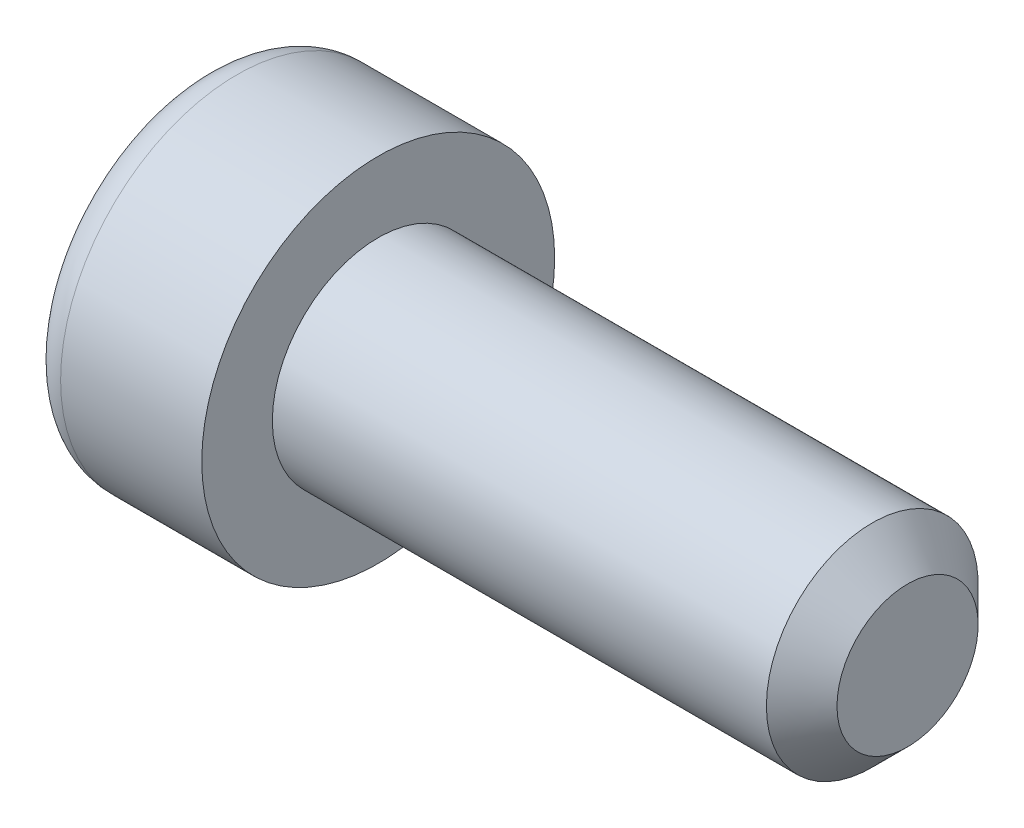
ISO-10303-21;
HEADER;
FILE_DESCRIPTION(('STEP AP214'),'2;1');
FILE_NAME('part.step','',(''),(''),'','','');
FILE_SCHEMA(('AUTOMOTIVE_DESIGN { 1 0 10303 214 1 1 1 1 }'));
ENDSEC;
DATA;
#1=APPLICATION_CONTEXT('core data for automotive mechanical design processes');
#2=APPLICATION_PROTOCOL_DEFINITION('international standard','automotive_design',2000,#1);
#3=PRODUCT_CONTEXT('',#1,'mechanical');
#4=PRODUCT('Part','Part','',(#3));
#5=PRODUCT_RELATED_PRODUCT_CATEGORY('part','',(#4));
#6=PRODUCT_DEFINITION_FORMATION('','',#4);
#7=PRODUCT_DEFINITION_CONTEXT('part definition',#1,'design');
#8=PRODUCT_DEFINITION('design','',#6,#7);
#9=PRODUCT_DEFINITION_SHAPE('','',#8);
#10=(LENGTH_UNIT() NAMED_UNIT(*) SI_UNIT(.MILLI.,.METRE.));
#11=(NAMED_UNIT(*) PLANE_ANGLE_UNIT() SI_UNIT($,.RADIAN.));
#12=(NAMED_UNIT(*) SI_UNIT($,.STERADIAN.) SOLID_ANGLE_UNIT());
#13=UNCERTAINTY_MEASURE_WITH_UNIT(LENGTH_MEASURE(1.E-05),#10,'distance_accuracy_value','');
#14=(GEOMETRIC_REPRESENTATION_CONTEXT(3) GLOBAL_UNCERTAINTY_ASSIGNED_CONTEXT((#13)) GLOBAL_UNIT_ASSIGNED_CONTEXT((#10,
#11,#12)) REPRESENTATION_CONTEXT('',''));
#15=CARTESIAN_POINT('',(0.,0.,0.));
#16=DIRECTION('',(0.,0.,1.));
#17=DIRECTION('',(1.,0.,0.));
#18=AXIS2_PLACEMENT_3D('',#15,#16,#17);
#19=CARTESIAN_POINT('',(41.305464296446,0.,0.));
#20=DIRECTION('',(-1.,0.,0.));
#21=DIRECTION('',(0.,0.,1.));
#22=AXIS2_PLACEMENT_3D('',#19,#20,#21);
#23=PLANE('',#22);
#24=CARTESIAN_POINT('',(41.305464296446,0.,0.));
#25=DIRECTION('',(-1.,0.,0.));
#26=DIRECTION('',(0.,0.,1.));
#27=AXIS2_PLACEMENT_3D('',#24,#25,#26);
#28=CIRCLE('',#27,2.);
#29=CARTESIAN_POINT('',(41.305464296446,0.,2.));
#30=VERTEX_POINT('',#29);
#31=EDGE_CURVE('E11',#30,#30,#28,.T.);
#32=ORIENTED_EDGE('',*,*,#31,.F.);
#33=EDGE_LOOP('',(#32));
#34=FACE_BOUND('',#33,.T.);
#35=ADVANCED_FACE('F33',(#34),#23,.F.);
#36=CARTESIAN_POINT('',(41.305464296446,0.,0.));
#37=DIRECTION('',(-1.,0.,0.));
#38=DIRECTION('',(0.,0.,1.));
#39=AXIS2_PLACEMENT_3D('',#36,#37,#38);
#40=CONICAL_SURFACE('',#39,2.,0.785398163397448);
#41=CARTESIAN_POINT('',(40.305464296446,0.,0.));
#42=DIRECTION('',(-1.,0.,0.));
#43=DIRECTION('',(0.,0.,1.));
#44=AXIS2_PLACEMENT_3D('',#41,#42,#43);
#45=CIRCLE('',#44,3.);
#46=CARTESIAN_POINT('',(40.305464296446,0.,3.));
#47=VERTEX_POINT('',#46);
#48=EDGE_CURVE('E40',#47,#47,#45,.T.);
#49=ORIENTED_EDGE('',*,*,#48,.F.);
#50=EDGE_LOOP('',(#49));
#51=FACE_BOUND('',#50,.T.);
#52=ORIENTED_EDGE('',*,*,#31,.T.);
#53=EDGE_LOOP('',(#52));
#54=FACE_BOUND('',#53,.T.);
#55=ADVANCED_FACE('F155',(#51,#54),#40,.T.);
#56=CARTESIAN_POINT('',(-45.6086238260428,0.,0.));
#57=DIRECTION('',(-1.,0.,0.));
#58=DIRECTION('',(0.,0.,1.));
#59=AXIS2_PLACEMENT_3D('',#56,#57,#58);
#60=CYLINDRICAL_SURFACE('',#59,3.);
#61=CARTESIAN_POINT('',(26.305464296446,0.,0.));
#62=DIRECTION('',(-1.,0.,0.));
#63=DIRECTION('',(0.,0.,1.));
#64=AXIS2_PLACEMENT_3D('',#61,#62,#63);
#65=CIRCLE('',#64,3.);
#66=CARTESIAN_POINT('',(26.305464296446,0.,3.));
#67=VERTEX_POINT('',#66);
#68=EDGE_CURVE('E148',#67,#67,#65,.T.);
#69=ORIENTED_EDGE('',*,*,#68,.F.);
#70=EDGE_LOOP('',(#69));
#71=FACE_BOUND('',#70,.T.);
#72=ORIENTED_EDGE('',*,*,#48,.T.);
#73=EDGE_LOOP('',(#72));
#74=FACE_BOUND('',#73,.T.);
#75=ADVANCED_FACE('F153',(#71,#74),#60,.T.);
#76=CARTESIAN_POINT('',(26.305464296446,3.,0.));
#77=DIRECTION('',(-1.,0.,0.));
#78=DIRECTION('',(0.,0.,1.));
#79=AXIS2_PLACEMENT_3D('',#76,#77,#78);
#80=PLANE('',#79);
#81=CARTESIAN_POINT('',(26.305464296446,0.,0.));
#82=DIRECTION('',(-1.,0.,0.));
#83=DIRECTION('',(0.,0.,1.));
#84=AXIS2_PLACEMENT_3D('',#81,#82,#83);
#85=CIRCLE('',#84,5.);
#86=CARTESIAN_POINT('',(26.305464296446,0.,5.));
#87=VERTEX_POINT('',#86);
#88=EDGE_CURVE('E145',#87,#87,#85,.T.);
#89=ORIENTED_EDGE('',*,*,#88,.F.);
#90=EDGE_LOOP('',(#89));
#91=FACE_BOUND('',#90,.T.);
#92=ORIENTED_EDGE('',*,*,#68,.T.);
#93=EDGE_LOOP('',(#92));
#94=FACE_BOUND('',#93,.T.);
#95=ADVANCED_FACE('F173',(#91,#94),#80,.F.);
#96=CARTESIAN_POINT('',(-45.6086238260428,0.,0.));
#97=DIRECTION('',(-1.,0.,0.));
#98=DIRECTION('',(0.,0.,1.));
#99=AXIS2_PLACEMENT_3D('',#96,#97,#98);
#100=CYLINDRICAL_SURFACE('',#99,5.);
#101=CARTESIAN_POINT('',(22.305464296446,0.,0.));
#102=DIRECTION('',(-1.,0.,0.));
#103=DIRECTION('',(0.,0.,1.));
#104=AXIS2_PLACEMENT_3D('',#101,#102,#103);
#105=CIRCLE('',#104,5.);
#106=CARTESIAN_POINT('',(22.305464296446,0.,5.));
#107=VERTEX_POINT('',#106);
#108=EDGE_CURVE('E142',#107,#107,#105,.T.);
#109=ORIENTED_EDGE('',*,*,#108,.F.);
#110=EDGE_LOOP('',(#109));
#111=FACE_BOUND('',#110,.T.);
#112=ORIENTED_EDGE('',*,*,#88,.T.);
#113=EDGE_LOOP('',(#112));
#114=FACE_BOUND('',#113,.T.);
#115=ADVANCED_FACE('F181',(#111,#114),#100,.T.);
#116=CARTESIAN_POINT('',(22.305464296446,0.,0.));
#117=DIRECTION('',(-1.,0.,0.));
#118=DIRECTION('',(0.,0.,1.));
#119=AXIS2_PLACEMENT_3D('',#116,#117,#118);
#120=TOROIDAL_SURFACE('',#119,4.,1.);
#121=CARTESIAN_POINT('',(21.305464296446,0.,0.));
#122=DIRECTION('',(-1.,0.,0.));
#123=DIRECTION('',(0.,0.,1.));
#124=AXIS2_PLACEMENT_3D('',#121,#122,#123);
#125=CIRCLE('',#124,3.99999999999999);
#126=CARTESIAN_POINT('',(21.305464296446,0.,3.99999999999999));
#127=VERTEX_POINT('',#126);
#128=EDGE_CURVE('E134',#127,#127,#125,.T.);
#129=ORIENTED_EDGE('',*,*,#128,.F.);
#130=EDGE_LOOP('',(#129));
#131=FACE_BOUND('',#130,.T.);
#132=ORIENTED_EDGE('',*,*,#108,.T.);
#133=EDGE_LOOP('',(#132));
#134=FACE_BOUND('',#133,.T.);
#135=ADVANCED_FACE('F189',(#131,#134),#120,.T.);
#136=CARTESIAN_POINT('',(21.305464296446,3.99999999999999,0.));
#137=DIRECTION('',(1.,0.,0.));
#138=DIRECTION('',(0.,0.,-1.));
#139=AXIS2_PLACEMENT_3D('',#136,#137,#138);
#140=PLANE('',#139);
#141=DIRECTION('',(0.,-0.500000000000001,-0.866025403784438));
#142=VECTOR('',#141,1.);
#143=CARTESIAN_POINT('',(21.305464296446,2.23575188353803,0.));
#144=LINE('',#143,#142);
#145=CARTESIAN_POINT('',(21.305464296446,2.23575188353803,0.));
#146=VERTEX_POINT('',#145);
#147=CARTESIAN_POINT('',(21.305464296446,1.11787594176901,-1.93621792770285));
#148=VERTEX_POINT('',#147);
#149=EDGE_CURVE('E121',#146,#148,#144,.T.);
#150=ORIENTED_EDGE('',*,*,#149,.F.);
#151=DIRECTION('',(0.,0.499999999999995,-0.866025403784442));
#152=VECTOR('',#151,1.);
#153=CARTESIAN_POINT('',(21.305464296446,1.11787594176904,1.93621792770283));
#154=LINE('',#153,#152);
#155=CARTESIAN_POINT('',(21.305464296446,1.11787594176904,1.93621792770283));
#156=VERTEX_POINT('',#155);
#157=EDGE_CURVE('E47',#156,#146,#154,.T.);
#158=ORIENTED_EDGE('',*,*,#157,.F.);
#159=DIRECTION('',(0.,1.,0.));
#160=VECTOR('',#159,1.);
#161=CARTESIAN_POINT('',(21.305464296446,-1.117875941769,1.93621792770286));
#162=LINE('',#161,#160);
#163=CARTESIAN_POINT('',(21.305464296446,-1.117875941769,1.93621792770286));
#164=VERTEX_POINT('',#163);
#165=EDGE_CURVE('E130',#164,#156,#162,.T.);
#166=ORIENTED_EDGE('',*,*,#165,.F.);
#167=DIRECTION('',(0.,0.500000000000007,0.866025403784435));
#168=VECTOR('',#167,1.);
#169=CARTESIAN_POINT('',(21.305464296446,-2.23575188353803,0.));
#170=LINE('',#169,#168);
#171=CARTESIAN_POINT('',(21.305464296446,-2.23575188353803,0.));
#172=VERTEX_POINT('',#171);
#173=EDGE_CURVE('E128',#172,#164,#170,.T.);
#174=ORIENTED_EDGE('',*,*,#173,.F.);
#175=DIRECTION('',(0.,-0.499999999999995,0.866025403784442));
#176=VECTOR('',#175,1.);
#177=CARTESIAN_POINT('',(21.305464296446,-1.11787594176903,-1.93621792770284));
#178=LINE('',#177,#176);
#179=CARTESIAN_POINT('',(21.305464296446,-1.11787594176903,-1.93621792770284));
#180=VERTEX_POINT('',#179);
#181=EDGE_CURVE('E95',#180,#172,#178,.T.);
#182=ORIENTED_EDGE('',*,*,#181,.F.);
#183=DIRECTION('',(0.,-1.,0.));
#184=VECTOR('',#183,1.);
#185=CARTESIAN_POINT('',(21.305464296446,1.11787594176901,-1.93621792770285));
#186=LINE('',#185,#184);
#187=EDGE_CURVE('E124',#148,#180,#186,.T.);
#188=ORIENTED_EDGE('',*,*,#187,.F.);
#189=EDGE_LOOP('',(#150,#158,#166,#174,#182,#188));
#190=FACE_BOUND('',#189,.T.);
#191=ORIENTED_EDGE('',*,*,#128,.T.);
#192=EDGE_LOOP('',(#191));
#193=FACE_BOUND('',#192,.T.);
#194=ADVANCED_FACE('F197',(#190,#193),#140,.F.);
#195=CARTESIAN_POINT('',(24.305464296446,1.11787594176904,1.93621792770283));
#196=DIRECTION('',(0.,0.866025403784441,0.499999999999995));
#197=DIRECTION('',(0.,-0.499999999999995,0.866025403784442));
#198=AXIS2_PLACEMENT_3D('',#195,#196,#197);
#199=PLANE('',#198);
#200=ORIENTED_EDGE('',*,*,#157,.T.);
#201=DIRECTION('',(-1.,0.,0.));
#202=VECTOR('',#201,1.);
#203=CARTESIAN_POINT('',(24.305464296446,2.23575188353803,0.));
#204=LINE('',#203,#202);
#205=CARTESIAN_POINT('',(24.305464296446,2.23575188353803,0.));
#206=VERTEX_POINT('',#205);
#207=EDGE_CURVE('E77',#206,#146,#204,.T.);
#208=ORIENTED_EDGE('',*,*,#207,.F.);
#209=DIRECTION('',(0.,0.499999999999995,-0.866025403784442));
#210=VECTOR('',#209,1.);
#211=CARTESIAN_POINT('',(24.305464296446,1.11787594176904,1.93621792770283));
#212=LINE('',#211,#210);
#213=CARTESIAN_POINT('',(24.305464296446,1.11787594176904,1.93621792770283));
#214=VERTEX_POINT('',#213);
#215=EDGE_CURVE('E132',#214,#206,#212,.T.);
#216=ORIENTED_EDGE('',*,*,#215,.F.);
#217=DIRECTION('',(-1.,0.,0.));
#218=VECTOR('',#217,1.);
#219=CARTESIAN_POINT('',(24.305464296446,1.11787594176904,1.93621792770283));
#220=LINE('',#219,#218);
#221=EDGE_CURVE('E55',#214,#156,#220,.T.);
#222=ORIENTED_EDGE('',*,*,#221,.T.);
#223=EDGE_LOOP('',(#200,#208,#216,#222));
#224=FACE_BOUND('',#223,.T.);
#225=ADVANCED_FACE('F206',(#224),#199,.F.);
#226=CARTESIAN_POINT('',(24.305464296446,-1.117875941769,1.93621792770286));
#227=DIRECTION('',(0.,0.,1.));
#228=DIRECTION('',(0.,-1.,0.));
#229=AXIS2_PLACEMENT_3D('',#226,#227,#228);
#230=PLANE('',#229);
#231=ORIENTED_EDGE('',*,*,#165,.T.);
#232=ORIENTED_EDGE('',*,*,#221,.F.);
#233=DIRECTION('',(0.,1.,0.));
#234=VECTOR('',#233,1.);
#235=CARTESIAN_POINT('',(24.305464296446,-1.117875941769,1.93621792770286));
#236=LINE('',#235,#234);
#237=CARTESIAN_POINT('',(24.305464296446,-1.117875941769,1.93621792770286));
#238=VERTEX_POINT('',#237);
#239=EDGE_CURVE('E107',#238,#214,#236,.T.);
#240=ORIENTED_EDGE('',*,*,#239,.F.);
#241=DIRECTION('',(-1.,0.,0.));
#242=VECTOR('',#241,1.);
#243=CARTESIAN_POINT('',(24.305464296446,-1.117875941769,1.93621792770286));
#244=LINE('',#243,#242);
#245=EDGE_CURVE('E99',#238,#164,#244,.T.);
#246=ORIENTED_EDGE('',*,*,#245,.T.);
#247=EDGE_LOOP('',(#231,#232,#240,#246));
#248=FACE_BOUND('',#247,.T.);
#249=ADVANCED_FACE('F216',(#248),#230,.F.);
#250=CARTESIAN_POINT('',(24.305464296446,-2.23575188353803,0.));
#251=DIRECTION('',(0.,-0.866025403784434,0.500000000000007));
#252=DIRECTION('',(0.,-0.500000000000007,-0.866025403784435));
#253=AXIS2_PLACEMENT_3D('',#250,#251,#252);
#254=PLANE('',#253);
#255=ORIENTED_EDGE('',*,*,#173,.T.);
#256=ORIENTED_EDGE('',*,*,#245,.F.);
#257=DIRECTION('',(0.,0.500000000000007,0.866025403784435));
#258=VECTOR('',#257,1.);
#259=CARTESIAN_POINT('',(24.305464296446,-2.23575188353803,0.));
#260=LINE('',#259,#258);
#261=CARTESIAN_POINT('',(24.305464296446,-2.23575188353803,0.));
#262=VERTEX_POINT('',#261);
#263=EDGE_CURVE('E103',#262,#238,#260,.T.);
#264=ORIENTED_EDGE('',*,*,#263,.F.);
#265=DIRECTION('',(-1.,0.,0.));
#266=VECTOR('',#265,1.);
#267=CARTESIAN_POINT('',(24.305464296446,-2.23575188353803,0.));
#268=LINE('',#267,#266);
#269=EDGE_CURVE('E88',#262,#172,#268,.T.);
#270=ORIENTED_EDGE('',*,*,#269,.T.);
#271=EDGE_LOOP('',(#255,#256,#264,#270));
#272=FACE_BOUND('',#271,.T.);
#273=ADVANCED_FACE('F104',(#272),#254,.F.);
#274=CARTESIAN_POINT('',(24.305464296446,-1.11787594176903,-1.93621792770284));
#275=DIRECTION('',(0.,-0.866025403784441,-0.499999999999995));
#276=DIRECTION('',(0.,0.499999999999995,-0.866025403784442));
#277=AXIS2_PLACEMENT_3D('',#274,#275,#276);
#278=PLANE('',#277);
#279=ORIENTED_EDGE('',*,*,#181,.T.);
#280=ORIENTED_EDGE('',*,*,#269,.F.);
#281=DIRECTION('',(0.,-0.499999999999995,0.866025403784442));
#282=VECTOR('',#281,1.);
#283=CARTESIAN_POINT('',(24.305464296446,-1.11787594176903,-1.93621792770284));
#284=LINE('',#283,#282);
#285=CARTESIAN_POINT('',(24.305464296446,-1.11787594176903,-1.93621792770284));
#286=VERTEX_POINT('',#285);
#287=EDGE_CURVE('E92',#286,#262,#284,.T.);
#288=ORIENTED_EDGE('',*,*,#287,.F.);
#289=DIRECTION('',(-1.,0.,0.));
#290=VECTOR('',#289,1.);
#291=CARTESIAN_POINT('',(24.305464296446,-1.11787594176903,-1.93621792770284));
#292=LINE('',#291,#290);
#293=EDGE_CURVE('E100',#286,#180,#292,.T.);
#294=ORIENTED_EDGE('',*,*,#293,.T.);
#295=EDGE_LOOP('',(#279,#280,#288,#294));
#296=FACE_BOUND('',#295,.T.);
#297=ADVANCED_FACE('F90',(#296),#278,.F.);
#298=CARTESIAN_POINT('',(24.305464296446,1.11787594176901,-1.93621792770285));
#299=DIRECTION('',(0.,0.,-1.));
#300=DIRECTION('',(0.,1.,0.));
#301=AXIS2_PLACEMENT_3D('',#298,#299,#300);
#302=PLANE('',#301);
#303=ORIENTED_EDGE('',*,*,#187,.T.);
#304=ORIENTED_EDGE('',*,*,#293,.F.);
#305=DIRECTION('',(0.,-1.,0.));
#306=VECTOR('',#305,1.);
#307=CARTESIAN_POINT('',(24.305464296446,1.11787594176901,-1.93621792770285));
#308=LINE('',#307,#306);
#309=CARTESIAN_POINT('',(24.305464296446,1.11787594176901,-1.93621792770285));
#310=VERTEX_POINT('',#309);
#311=EDGE_CURVE('E113',#310,#286,#308,.T.);
#312=ORIENTED_EDGE('',*,*,#311,.F.);
#313=DIRECTION('',(-1.,0.,0.));
#314=VECTOR('',#313,1.);
#315=CARTESIAN_POINT('',(24.305464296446,1.11787594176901,-1.93621792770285));
#316=LINE('',#315,#314);
#317=EDGE_CURVE('E137',#310,#148,#316,.T.);
#318=ORIENTED_EDGE('',*,*,#317,.T.);
#319=EDGE_LOOP('',(#303,#304,#312,#318));
#320=FACE_BOUND('',#319,.T.);
#321=ADVANCED_FACE('F234',(#320),#302,.F.);
#322=CARTESIAN_POINT('',(24.305464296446,2.23575188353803,0.));
#323=DIRECTION('',(0.,0.866025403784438,-0.500000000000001));
#324=DIRECTION('',(0.,0.500000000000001,0.866025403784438));
#325=AXIS2_PLACEMENT_3D('',#322,#323,#324);
#326=PLANE('',#325);
#327=ORIENTED_EDGE('',*,*,#149,.T.);
#328=ORIENTED_EDGE('',*,*,#317,.F.);
#329=DIRECTION('',(0.,-0.500000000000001,-0.866025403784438));
#330=VECTOR('',#329,1.);
#331=CARTESIAN_POINT('',(24.305464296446,2.23575188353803,0.));
#332=LINE('',#331,#330);
#333=EDGE_CURVE('E115',#206,#310,#332,.T.);
#334=ORIENTED_EDGE('',*,*,#333,.F.);
#335=ORIENTED_EDGE('',*,*,#207,.T.);
#336=EDGE_LOOP('',(#327,#328,#334,#335));
#337=FACE_BOUND('',#336,.T.);
#338=ADVANCED_FACE('F241',(#337),#326,.F.);
#339=CARTESIAN_POINT('',(24.305464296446,2.23575188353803,0.));
#340=DIRECTION('',(-1.,0.,0.));
#341=DIRECTION('',(0.,0.,1.));
#342=AXIS2_PLACEMENT_3D('',#339,#340,#341);
#343=PLANE('',#342);
#344=ORIENTED_EDGE('',*,*,#215,.T.);
#345=ORIENTED_EDGE('',*,*,#333,.T.);
#346=ORIENTED_EDGE('',*,*,#311,.T.);
#347=ORIENTED_EDGE('',*,*,#287,.T.);
#348=ORIENTED_EDGE('',*,*,#263,.T.);
#349=ORIENTED_EDGE('',*,*,#239,.T.);
#350=EDGE_LOOP('',(#344,#345,#346,#347,#348,#349));
#351=FACE_BOUND('',#350,.T.);
#352=ADVANCED_FACE('F110',(#351),#343,.T.);
#353=CLOSED_SHELL('',(#35,#55,#75,#95,#115,#135,#194,#225,#249,#273,#297,#321,#338,#352));
#354=MANIFOLD_SOLID_BREP('B2',#353);
#355=ADVANCED_BREP_SHAPE_REPRESENTATION('',(#18,#354),#14);
#356=SHAPE_DEFINITION_REPRESENTATION(#9,#355);
ENDSEC;
END-ISO-10303-21;
